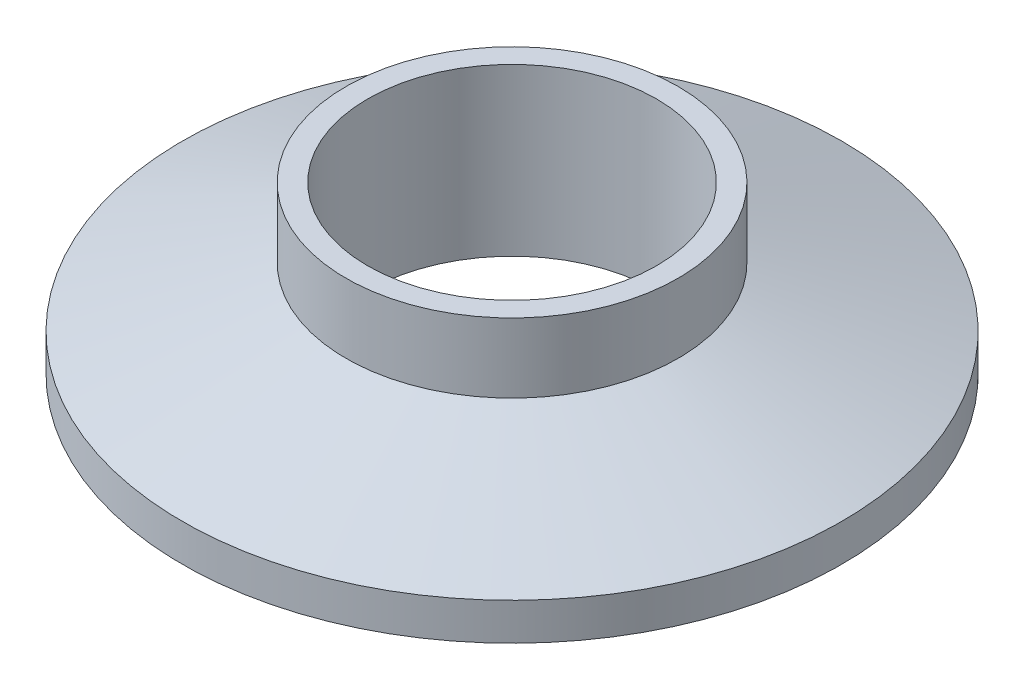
ISO-10303-21;
HEADER;
FILE_DESCRIPTION(('STEP AP214'),'2;1');
FILE_NAME('part.step','',(''),(''),'','','');
FILE_SCHEMA(('AUTOMOTIVE_DESIGN { 1 0 10303 214 1 1 1 1 }'));
ENDSEC;
DATA;
#1=APPLICATION_CONTEXT('core data for automotive mechanical design processes');
#2=APPLICATION_PROTOCOL_DEFINITION('international standard','automotive_design',2000,#1);
#3=PRODUCT_CONTEXT('',#1,'mechanical');
#4=PRODUCT('Part','Part','',(#3));
#5=PRODUCT_RELATED_PRODUCT_CATEGORY('part','',(#4));
#6=PRODUCT_DEFINITION_FORMATION('','',#4);
#7=PRODUCT_DEFINITION_CONTEXT('part definition',#1,'design');
#8=PRODUCT_DEFINITION('design','',#6,#7);
#9=PRODUCT_DEFINITION_SHAPE('','',#8);
#10=(LENGTH_UNIT() NAMED_UNIT(*) SI_UNIT(.MILLI.,.METRE.));
#11=(NAMED_UNIT(*) PLANE_ANGLE_UNIT() SI_UNIT($,.RADIAN.));
#12=(NAMED_UNIT(*) SI_UNIT($,.STERADIAN.) SOLID_ANGLE_UNIT());
#13=UNCERTAINTY_MEASURE_WITH_UNIT(LENGTH_MEASURE(1.E-05),#10,'distance_accuracy_value','');
#14=(GEOMETRIC_REPRESENTATION_CONTEXT(3) GLOBAL_UNCERTAINTY_ASSIGNED_CONTEXT((#13)) GLOBAL_UNIT_ASSIGNED_CONTEXT((#10,
#11,#12)) REPRESENTATION_CONTEXT('',''));
#15=CARTESIAN_POINT('',(0.,0.,0.));
#16=DIRECTION('',(0.,0.,1.));
#17=DIRECTION('',(1.,0.,0.));
#18=AXIS2_PLACEMENT_3D('',#15,#16,#17);
#19=CARTESIAN_POINT('',(0.,0.7874,0.));
#20=DIRECTION('',(0.,-1.,0.));
#21=DIRECTION('',(0.,0.,-1.));
#22=AXIS2_PLACEMENT_3D('',#19,#20,#21);
#23=TOROIDAL_SURFACE('',#22,23.6366084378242,0.787399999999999);
#24=CARTESIAN_POINT('',(0.,0.,0.));
#25=DIRECTION('',(0.,-1.,0.));
#26=DIRECTION('',(0.,0.,-1.));
#27=AXIS2_PLACEMENT_3D('',#24,#25,#26);
#28=CIRCLE('',#27,23.6366084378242);
#29=CARTESIAN_POINT('',(0.,0.,-23.6366084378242));
#30=VERTEX_POINT('',#29);
#31=EDGE_CURVE('E67',#30,#30,#28,.T.);
#32=ORIENTED_EDGE('',*,*,#31,.T.);
#33=EDGE_LOOP('',(#32));
#34=FACE_BOUND('',#33,.T.);
#35=CARTESIAN_POINT('',(0.,0.474458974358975,0.));
#36=DIRECTION('',(0.,-1.,0.));
#37=DIRECTION('',(0.,0.,-1.));
#38=AXIS2_PLACEMENT_3D('',#35,#36,#37);
#39=CIRCLE('',#38,22.9140666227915);
#40=CARTESIAN_POINT('',(0.,0.474458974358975,-22.9140666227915));
#41=VERTEX_POINT('',#40);
#42=EDGE_CURVE('E10',#41,#41,#39,.T.);
#43=ORIENTED_EDGE('',*,*,#42,.F.);
#44=EDGE_LOOP('',(#43));
#45=FACE_BOUND('',#44,.T.);
#46=ADVANCED_FACE('F33',(#34,#45),#23,.T.);
#47=CARTESIAN_POINT('',(0.,0.,0.));
#48=DIRECTION('',(0.,-1.,0.));
#49=DIRECTION('',(0.,0.,-1.));
#50=AXIS2_PLACEMENT_3D('',#47,#48,#49);
#51=TOROIDAL_SURFACE('',#50,21.8186,1.1938);
#52=CARTESIAN_POINT('',(0.,0.474458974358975,0.));
#53=DIRECTION('',(0.,-1.,0.));
#54=DIRECTION('',(0.,0.,-1.));
#55=AXIS2_PLACEMENT_3D('',#52,#53,#54);
#56=CIRCLE('',#55,20.7231333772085);
#57=CARTESIAN_POINT('',(0.,0.474458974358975,-20.7231333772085));
#58=VERTEX_POINT('',#57);
#59=EDGE_CURVE('E39',#58,#58,#56,.T.);
#60=ORIENTED_EDGE('',*,*,#59,.F.);
#61=EDGE_LOOP('',(#60));
#62=FACE_BOUND('',#61,.T.);
#63=ORIENTED_EDGE('',*,*,#42,.T.);
#64=EDGE_LOOP('',(#63));
#65=FACE_BOUND('',#64,.T.);
#66=ADVANCED_FACE('F115',(#62,#65),#51,.F.);
#67=CARTESIAN_POINT('',(0.,0.787400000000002,0.));
#68=DIRECTION('',(0.,-1.,0.));
#69=DIRECTION('',(0.,0.,-1.));
#70=AXIS2_PLACEMENT_3D('',#67,#68,#69);
#71=TOROIDAL_SURFACE('',#70,20.0005915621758,0.787399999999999);
#72=ORIENTED_EDGE('',*,*,#59,.T.);
#73=EDGE_LOOP('',(#72));
#74=FACE_BOUND('',#73,.T.);
#75=CARTESIAN_POINT('',(0.,0.,0.));
#76=DIRECTION('',(0.,-1.,0.));
#77=DIRECTION('',(0.,0.,-1.));
#78=AXIS2_PLACEMENT_3D('',#75,#76,#77);
#79=CIRCLE('',#78,20.0005915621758);
#80=CARTESIAN_POINT('',(0.,0.,-20.0005915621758));
#81=VERTEX_POINT('',#80);
#82=EDGE_CURVE('E43',#81,#81,#79,.T.);
#83=ORIENTED_EDGE('',*,*,#82,.F.);
#84=EDGE_LOOP('',(#83));
#85=FACE_BOUND('',#84,.T.);
#86=ADVANCED_FACE('F111',(#74,#85),#71,.T.);
#87=CARTESIAN_POINT('',(0.,0.,0.));
#88=DIRECTION('',(0.,1.,0.));
#89=DIRECTION('',(0.,0.,1.));
#90=AXIS2_PLACEMENT_3D('',#87,#88,#89);
#91=PLANE('',#90);
#92=CARTESIAN_POINT('',(0.,0.,0.));
#93=DIRECTION('',(0.,-1.,0.));
#94=DIRECTION('',(0.,0.,-1.));
#95=AXIS2_PLACEMENT_3D('',#92,#93,#94);
#96=CIRCLE('',#95,11.049);
#97=CARTESIAN_POINT('',(0.,0.,-11.049));
#98=VERTEX_POINT('',#97);
#99=EDGE_CURVE('E47',#98,#98,#96,.T.);
#100=ORIENTED_EDGE('',*,*,#99,.F.);
#101=EDGE_LOOP('',(#100));
#102=FACE_BOUND('',#101,.T.);
#103=ORIENTED_EDGE('',*,*,#82,.T.);
#104=EDGE_LOOP('',(#103));
#105=FACE_BOUND('',#104,.T.);
#106=ADVANCED_FACE('F105',(#102,#105),#91,.F.);
#107=CARTESIAN_POINT('',(0.,0.,0.));
#108=DIRECTION('',(0.,-1.,0.));
#109=DIRECTION('',(0.,0.,-1.));
#110=AXIS2_PLACEMENT_3D('',#107,#108,#109);
#111=CYLINDRICAL_SURFACE('',#110,11.049);
#112=ORIENTED_EDGE('',*,*,#99,.T.);
#113=EDGE_LOOP('',(#112));
#114=FACE_BOUND('',#113,.T.);
#115=CARTESIAN_POINT('',(0.,12.7,0.));
#116=DIRECTION('',(0.,-1.,0.));
#117=DIRECTION('',(0.,0.,-1.));
#118=AXIS2_PLACEMENT_3D('',#115,#116,#117);
#119=CIRCLE('',#118,11.049);
#120=CARTESIAN_POINT('',(0.,12.7,-11.049));
#121=VERTEX_POINT('',#120);
#122=EDGE_CURVE('E52',#121,#121,#119,.T.);
#123=ORIENTED_EDGE('',*,*,#122,.F.);
#124=EDGE_LOOP('',(#123));
#125=FACE_BOUND('',#124,.T.);
#126=ADVANCED_FACE('F100',(#114,#125),#111,.F.);
#127=CARTESIAN_POINT('',(0.,12.7,0.));
#128=DIRECTION('',(0.,-1.,0.));
#129=DIRECTION('',(0.,0.,-1.));
#130=AXIS2_PLACEMENT_3D('',#127,#128,#129);
#131=PLANE('',#130);
#132=CARTESIAN_POINT('',(0.,12.7,0.));
#133=DIRECTION('',(0.,-1.,0.));
#134=DIRECTION('',(0.,0.,-1.));
#135=AXIS2_PLACEMENT_3D('',#132,#133,#134);
#136=CIRCLE('',#135,12.7);
#137=CARTESIAN_POINT('',(0.,12.7,-12.7));
#138=VERTEX_POINT('',#137);
#139=EDGE_CURVE('E55',#138,#138,#136,.T.);
#140=ORIENTED_EDGE('',*,*,#139,.F.);
#141=EDGE_LOOP('',(#140));
#142=FACE_BOUND('',#141,.T.);
#143=ORIENTED_EDGE('',*,*,#122,.T.);
#144=EDGE_LOOP('',(#143));
#145=FACE_BOUND('',#144,.T.);
#146=ADVANCED_FACE('F94',(#142,#145),#131,.F.);
#147=CARTESIAN_POINT('',(0.,0.,0.));
#148=DIRECTION('',(0.,-1.,0.));
#149=DIRECTION('',(0.,0.,-1.));
#150=AXIS2_PLACEMENT_3D('',#147,#148,#149);
#151=CYLINDRICAL_SURFACE('',#150,12.7);
#152=CARTESIAN_POINT('',(0.,7.39326322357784,0.));
#153=DIRECTION('',(0.,-1.,0.));
#154=DIRECTION('',(0.,0.,-1.));
#155=AXIS2_PLACEMENT_3D('',#152,#153,#154);
#156=CIRCLE('',#155,12.7);
#157=CARTESIAN_POINT('',(0.,7.39326322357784,-12.7));
#158=VERTEX_POINT('',#157);
#159=EDGE_CURVE('E58',#158,#158,#156,.T.);
#160=ORIENTED_EDGE('',*,*,#159,.F.);
#161=EDGE_LOOP('',(#160));
#162=FACE_BOUND('',#161,.T.);
#163=ORIENTED_EDGE('',*,*,#139,.T.);
#164=EDGE_LOOP('',(#163));
#165=FACE_BOUND('',#164,.T.);
#166=ADVANCED_FACE('F88',(#162,#165),#151,.T.);
#167=CARTESIAN_POINT('',(0.,7.39326322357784,0.));
#168=DIRECTION('',(0.,-1.,0.));
#169=DIRECTION('',(0.,0.,-1.));
#170=AXIS2_PLACEMENT_3D('',#167,#168,#169);
#171=CONICAL_SURFACE('',#170,12.7,1.22173047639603);
#172=CARTESIAN_POINT('',(0.,2.8448,0.));
#173=DIRECTION('',(0.,-1.,0.));
#174=DIRECTION('',(0.,0.,-1.));
#175=AXIS2_PLACEMENT_3D('',#172,#173,#174);
#176=CIRCLE('',#175,25.1968);
#177=CARTESIAN_POINT('',(0.,2.8448,-25.1968));
#178=VERTEX_POINT('',#177);
#179=EDGE_CURVE('E61',#178,#178,#176,.T.);
#180=ORIENTED_EDGE('',*,*,#179,.F.);
#181=EDGE_LOOP('',(#180));
#182=FACE_BOUND('',#181,.T.);
#183=ORIENTED_EDGE('',*,*,#159,.T.);
#184=EDGE_LOOP('',(#183));
#185=FACE_BOUND('',#184,.T.);
#186=ADVANCED_FACE('F82',(#182,#185),#171,.T.);
#187=CARTESIAN_POINT('',(0.,0.,0.));
#188=DIRECTION('',(0.,-1.,0.));
#189=DIRECTION('',(0.,0.,-1.));
#190=AXIS2_PLACEMENT_3D('',#187,#188,#189);
#191=CYLINDRICAL_SURFACE('',#190,25.1968);
#192=CARTESIAN_POINT('',(0.,0.,0.));
#193=DIRECTION('',(0.,-1.,0.));
#194=DIRECTION('',(0.,0.,-1.));
#195=AXIS2_PLACEMENT_3D('',#192,#193,#194);
#196=CIRCLE('',#195,25.1968);
#197=CARTESIAN_POINT('',(0.,0.,-25.1968));
#198=VERTEX_POINT('',#197);
#199=EDGE_CURVE('E64',#198,#198,#196,.T.);
#200=ORIENTED_EDGE('',*,*,#199,.F.);
#201=EDGE_LOOP('',(#200));
#202=FACE_BOUND('',#201,.T.);
#203=ORIENTED_EDGE('',*,*,#179,.T.);
#204=EDGE_LOOP('',(#203));
#205=FACE_BOUND('',#204,.T.);
#206=ADVANCED_FACE('F76',(#202,#205),#191,.T.);
#207=CARTESIAN_POINT('',(0.,0.,0.));
#208=DIRECTION('',(0.,1.,0.));
#209=DIRECTION('',(0.,0.,1.));
#210=AXIS2_PLACEMENT_3D('',#207,#208,#209);
#211=PLANE('',#210);
#212=ORIENTED_EDGE('',*,*,#31,.F.);
#213=EDGE_LOOP('',(#212));
#214=FACE_BOUND('',#213,.T.);
#215=ORIENTED_EDGE('',*,*,#199,.T.);
#216=EDGE_LOOP('',(#215));
#217=FACE_BOUND('',#216,.T.);
#218=ADVANCED_FACE('F73',(#214,#217),#211,.F.);
#219=CLOSED_SHELL('',(#46,#66,#86,#106,#126,#146,#166,#186,#206,#218));
#220=MANIFOLD_SOLID_BREP('B2',#219);
#221=ADVANCED_BREP_SHAPE_REPRESENTATION('',(#18,#220),#14);
#222=SHAPE_DEFINITION_REPRESENTATION(#9,#221);
ENDSEC;
END-ISO-10303-21;
